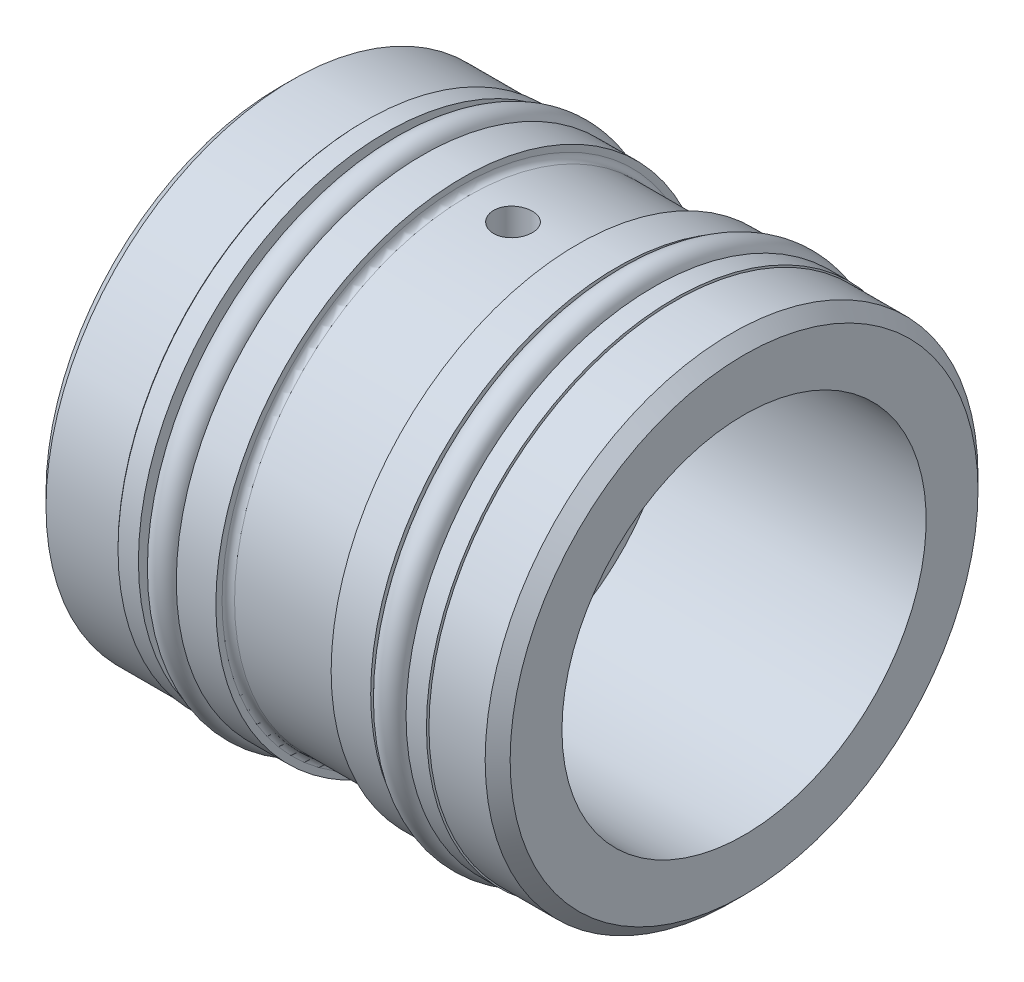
ISO-10303-21;
HEADER;
FILE_DESCRIPTION(('STEP AP214'),'2;1');
FILE_NAME('part.step','',(''),(''),'','','');
FILE_SCHEMA(('AUTOMOTIVE_DESIGN { 1 0 10303 214 1 1 1 1 }'));
ENDSEC;
DATA;
#1=APPLICATION_CONTEXT('core data for automotive mechanical design processes');
#2=APPLICATION_PROTOCOL_DEFINITION('international standard','automotive_design',2000,#1);
#3=PRODUCT_CONTEXT('',#1,'mechanical');
#4=PRODUCT('Part','Part','',(#3));
#5=PRODUCT_RELATED_PRODUCT_CATEGORY('part','',(#4));
#6=PRODUCT_DEFINITION_FORMATION('','',#4);
#7=PRODUCT_DEFINITION_CONTEXT('part definition',#1,'design');
#8=PRODUCT_DEFINITION('design','',#6,#7);
#9=PRODUCT_DEFINITION_SHAPE('','',#8);
#10=(LENGTH_UNIT() NAMED_UNIT(*) SI_UNIT(.MILLI.,.METRE.));
#11=(NAMED_UNIT(*) PLANE_ANGLE_UNIT() SI_UNIT($,.RADIAN.));
#12=(NAMED_UNIT(*) SI_UNIT($,.STERADIAN.) SOLID_ANGLE_UNIT());
#13=UNCERTAINTY_MEASURE_WITH_UNIT(LENGTH_MEASURE(1.E-05),#10,'distance_accuracy_value','');
#14=(GEOMETRIC_REPRESENTATION_CONTEXT(3) GLOBAL_UNCERTAINTY_ASSIGNED_CONTEXT((#13)) GLOBAL_UNIT_ASSIGNED_CONTEXT((#10,
#11,#12)) REPRESENTATION_CONTEXT('',''));
#15=CARTESIAN_POINT('',(0.,0.,0.));
#16=DIRECTION('',(0.,0.,1.));
#17=DIRECTION('',(1.,0.,0.));
#18=AXIS2_PLACEMENT_3D('',#15,#16,#17);
#19=CARTESIAN_POINT('',(0.,0.,0.));
#20=DIRECTION('',(-1.,0.,0.));
#21=DIRECTION('',(0.,0.,1.));
#22=AXIS2_PLACEMENT_3D('',#19,#20,#21);
#23=CYLINDRICAL_SURFACE('',#22,13.7668);
#24=CARTESIAN_POINT('',(7.73880715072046,0.,0.));
#25=DIRECTION('',(-1.,0.,0.));
#26=DIRECTION('',(0.,0.,1.));
#27=AXIS2_PLACEMENT_3D('',#24,#25,#26);
#28=CIRCLE('',#27,13.7668);
#29=CARTESIAN_POINT('',(7.73880715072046,0.,13.7668));
#30=VERTEX_POINT('',#29);
#31=EDGE_CURVE('E147',#30,#30,#28,.T.);
#32=ORIENTED_EDGE('',*,*,#31,.F.);
#33=EDGE_LOOP('',(#32));
#34=FACE_BOUND('',#33,.T.);
#35=CARTESIAN_POINT('',(8.6487,0.,0.));
#36=DIRECTION('',(1.,0.,0.));
#37=DIRECTION('',(0.,0.,-1.));
#38=AXIS2_PLACEMENT_3D('',#35,#36,#37);
#39=CIRCLE('',#38,13.7668);
#40=CARTESIAN_POINT('',(8.6487,0.,-13.7668));
#41=VERTEX_POINT('',#40);
#42=EDGE_CURVE('E10',#41,#41,#39,.T.);
#43=ORIENTED_EDGE('',*,*,#42,.F.);
#44=EDGE_LOOP('',(#43));
#45=FACE_BOUND('',#44,.T.);
#46=ADVANCED_FACE('F32',(#34,#45),#23,.T.);
#47=CARTESIAN_POINT('',(9.9695,0.,0.));
#48=DIRECTION('',(-1.,0.,0.));
#49=DIRECTION('',(0.,0.,1.));
#50=AXIS2_PLACEMENT_3D('',#47,#48,#49);
#51=CIRCLE('',#50,13.7668);
#52=CARTESIAN_POINT('',(9.9695,0.,13.7668));
#53=VERTEX_POINT('',#52);
#54=EDGE_CURVE('E199',#53,#53,#51,.T.);
#55=ORIENTED_EDGE('',*,*,#54,.T.);
#56=EDGE_LOOP('',(#55));
#57=FACE_BOUND('',#56,.T.);
#58=CARTESIAN_POINT('',(9.89329999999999,0.,0.));
#59=DIRECTION('',(-1.,0.,0.));
#60=DIRECTION('',(0.,0.,1.));
#61=AXIS2_PLACEMENT_3D('',#58,#59,#60);
#62=CIRCLE('',#61,13.7668);
#63=CARTESIAN_POINT('',(9.89329999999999,0.,13.7668));
#64=VERTEX_POINT('',#63);
#65=EDGE_CURVE('E44',#64,#64,#62,.T.);
#66=ORIENTED_EDGE('',*,*,#65,.F.);
#67=EDGE_LOOP('',(#66));
#68=FACE_BOUND('',#67,.T.);
#69=ADVANCED_FACE('F119',(#57,#68),#23,.T.);
#70=CARTESIAN_POINT('',(6.4135,0.,0.));
#71=DIRECTION('',(-1.,0.,0.));
#72=DIRECTION('',(0.,0.,1.));
#73=AXIS2_PLACEMENT_3D('',#70,#71,#72);
#74=CIRCLE('',#73,13.7668);
#75=CARTESIAN_POINT('',(6.4135,0.,13.7668));
#76=VERTEX_POINT('',#75);
#77=EDGE_CURVE('E143',#76,#76,#74,.T.);
#78=ORIENTED_EDGE('',*,*,#77,.F.);
#79=EDGE_LOOP('',(#78));
#80=FACE_BOUND('',#79,.T.);
#81=CARTESIAN_POINT('',(7.01859284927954,0.,0.));
#82=DIRECTION('',(1.,0.,0.));
#83=DIRECTION('',(0.,0.,-1.));
#84=AXIS2_PLACEMENT_3D('',#81,#82,#83);
#85=CIRCLE('',#84,13.7668);
#86=CARTESIAN_POINT('',(7.01859284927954,0.,-13.7668));
#87=VERTEX_POINT('',#86);
#88=EDGE_CURVE('E49',#87,#87,#85,.T.);
#89=ORIENTED_EDGE('',*,*,#88,.F.);
#90=EDGE_LOOP('',(#89));
#91=FACE_BOUND('',#90,.T.);
#92=ADVANCED_FACE('F122',(#80,#91),#23,.T.);
#93=CARTESIAN_POINT('',(0.,0.,0.));
#94=DIRECTION('',(-1.,0.,0.));
#95=DIRECTION('',(0.,0.,1.));
#96=AXIS2_PLACEMENT_3D('',#93,#94,#95);
#97=CYLINDRICAL_SURFACE('',#96,13.7668);
#98=CARTESIAN_POINT('',(-7.6835,0.,0.));
#99=DIRECTION('',(-1.,0.,0.));
#100=DIRECTION('',(0.,0.,1.));
#101=AXIS2_PLACEMENT_3D('',#98,#99,#100);
#102=CIRCLE('',#101,13.7668);
#103=CARTESIAN_POINT('',(-7.6835,0.,13.7668));
#104=VERTEX_POINT('',#103);
#105=EDGE_CURVE('E160',#104,#104,#102,.T.);
#106=ORIENTED_EDGE('',*,*,#105,.F.);
#107=EDGE_LOOP('',(#106));
#108=FACE_BOUND('',#107,.T.);
#109=CARTESIAN_POINT('',(-6.77360715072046,0.,0.));
#110=DIRECTION('',(1.,0.,0.));
#111=DIRECTION('',(0.,0.,-1.));
#112=AXIS2_PLACEMENT_3D('',#109,#110,#111);
#113=CIRCLE('',#112,13.7668);
#114=CARTESIAN_POINT('',(-6.77360715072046,0.,-13.7668));
#115=VERTEX_POINT('',#114);
#116=EDGE_CURVE('E149',#115,#115,#113,.T.);
#117=ORIENTED_EDGE('',*,*,#116,.F.);
#118=EDGE_LOOP('',(#117));
#119=FACE_BOUND('',#118,.T.);
#120=ADVANCED_FACE('F132',(#108,#119),#97,.T.);
#121=CARTESIAN_POINT('',(-5.4483,0.,0.));
#122=DIRECTION('',(-1.,0.,0.));
#123=DIRECTION('',(0.,0.,1.));
#124=AXIS2_PLACEMENT_3D('',#121,#122,#123);
#125=CIRCLE('',#124,13.7668);
#126=CARTESIAN_POINT('',(-5.4483,0.,13.7668));
#127=VERTEX_POINT('',#126);
#128=EDGE_CURVE('E215',#127,#127,#125,.T.);
#129=ORIENTED_EDGE('',*,*,#128,.T.);
#130=EDGE_LOOP('',(#129));
#131=FACE_BOUND('',#130,.T.);
#132=CARTESIAN_POINT('',(-6.05339284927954,0.,0.));
#133=DIRECTION('',(-1.,0.,0.));
#134=DIRECTION('',(0.,0.,1.));
#135=AXIS2_PLACEMENT_3D('',#132,#133,#134);
#136=CIRCLE('',#135,13.7668);
#137=CARTESIAN_POINT('',(-6.05339284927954,0.,13.7668));
#138=VERTEX_POINT('',#137);
#139=EDGE_CURVE('E154',#138,#138,#136,.T.);
#140=ORIENTED_EDGE('',*,*,#139,.F.);
#141=EDGE_LOOP('',(#140));
#142=FACE_BOUND('',#141,.T.);
#143=ADVANCED_FACE('F137',(#131,#142),#97,.T.);
#144=CARTESIAN_POINT('',(-9.0043,0.,0.));
#145=DIRECTION('',(-1.,0.,0.));
#146=DIRECTION('',(0.,0.,1.));
#147=AXIS2_PLACEMENT_3D('',#144,#145,#146);
#148=CIRCLE('',#147,13.7668);
#149=CARTESIAN_POINT('',(-9.0043,0.,13.7668));
#150=VERTEX_POINT('',#149);
#151=EDGE_CURVE('E218',#150,#150,#148,.T.);
#152=ORIENTED_EDGE('',*,*,#151,.F.);
#153=EDGE_LOOP('',(#152));
#154=FACE_BOUND('',#153,.T.);
#155=CARTESIAN_POINT('',(-8.9281,0.,0.));
#156=DIRECTION('',(1.,0.,0.));
#157=DIRECTION('',(0.,0.,-1.));
#158=AXIS2_PLACEMENT_3D('',#155,#156,#157);
#159=CIRCLE('',#158,13.7668);
#160=CARTESIAN_POINT('',(-8.9281,0.,-13.7668));
#161=VERTEX_POINT('',#160);
#162=EDGE_CURVE('E157',#161,#161,#159,.T.);
#163=ORIENTED_EDGE('',*,*,#162,.F.);
#164=EDGE_LOOP('',(#163));
#165=FACE_BOUND('',#164,.T.);
#166=ADVANCED_FACE('F98',(#154,#165),#97,.T.);
#167=CARTESIAN_POINT('',(0.,0.,0.));
#168=DIRECTION('',(-1.,0.,0.));
#169=DIRECTION('',(0.,0.,1.));
#170=AXIS2_PLACEMENT_3D('',#167,#168,#169);
#171=CYLINDRICAL_SURFACE('',#170,6.35);
#172=CARTESIAN_POINT('',(-1.2319,0.,0.));
#173=DIRECTION('',(-1.,0.,0.));
#174=DIRECTION('',(0.,0.,1.));
#175=AXIS2_PLACEMENT_3D('',#172,#173,#174);
#176=CIRCLE('',#175,6.35);
#177=CARTESIAN_POINT('',(-1.2319,0.,6.35));
#178=VERTEX_POINT('',#177);
#179=EDGE_CURVE('E187',#178,#178,#176,.T.);
#180=ORIENTED_EDGE('',*,*,#179,.F.);
#181=EDGE_LOOP('',(#180));
#182=FACE_BOUND('',#181,.T.);
#183=CARTESIAN_POINT('',(-14.1605,0.,0.));
#184=DIRECTION('',(-1.,0.,0.));
#185=DIRECTION('',(0.,0.,1.));
#186=AXIS2_PLACEMENT_3D('',#183,#184,#185);
#187=CIRCLE('',#186,6.35);
#188=CARTESIAN_POINT('',(-14.1605,0.,6.35));
#189=VERTEX_POINT('',#188);
#190=EDGE_CURVE('E224',#189,#189,#187,.T.);
#191=ORIENTED_EDGE('',*,*,#190,.T.);
#192=EDGE_LOOP('',(#191));
#193=FACE_BOUND('',#192,.T.);
#194=ADVANCED_FACE('F94',(#182,#193),#171,.F.);
#195=CARTESIAN_POINT('',(-1.2319,6.35,0.));
#196=DIRECTION('',(-1.,0.,0.));
#197=DIRECTION('',(0.,0.,1.));
#198=AXIS2_PLACEMENT_3D('',#195,#196,#197);
#199=PLANE('',#198);
#200=CARTESIAN_POINT('',(-1.2319,0.,0.));
#201=DIRECTION('',(-1.,0.,0.));
#202=DIRECTION('',(0.,0.,1.));
#203=AXIS2_PLACEMENT_3D('',#200,#201,#202);
#204=CIRCLE('',#203,11.1125);
#205=CARTESIAN_POINT('',(-1.2319,0.,11.1125));
#206=VERTEX_POINT('',#205);
#207=EDGE_CURVE('E190',#206,#206,#204,.T.);
#208=ORIENTED_EDGE('',*,*,#207,.F.);
#209=EDGE_LOOP('',(#208));
#210=FACE_BOUND('',#209,.T.);
#211=ORIENTED_EDGE('',*,*,#179,.T.);
#212=EDGE_LOOP('',(#211));
#213=FACE_BOUND('',#212,.T.);
#214=ADVANCED_FACE('F88',(#210,#213),#199,.F.);
#215=CARTESIAN_POINT('',(0.,0.,0.));
#216=DIRECTION('',(-1.,0.,0.));
#217=DIRECTION('',(0.,0.,1.));
#218=AXIS2_PLACEMENT_3D('',#215,#216,#217);
#219=CYLINDRICAL_SURFACE('',#218,11.1125);
#220=CARTESIAN_POINT('',(0.0634999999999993,-11.0495546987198,1.1811));
#221=CARTESIAN_POINT('',(-0.00264156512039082,-11.0495555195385,1.18109714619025));
#222=CARTESIAN_POINT('',(-0.0688263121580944,-11.0501549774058,1.17552539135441));
#223=CARTESIAN_POINT('',(-0.199359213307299,-11.0524875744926,1.15338363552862));
#224=CARTESIAN_POINT('',(-0.263705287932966,-11.054221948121,1.13680165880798));
#225=CARTESIAN_POINT('',(-0.388651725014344,-11.0586257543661,1.09312916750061));
#226=CARTESIAN_POINT('',(-0.449254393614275,-11.0612946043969,1.06604519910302));
#227=CARTESIAN_POINT('',(-0.565041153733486,-11.0672659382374,1.00215046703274));
#228=CARTESIAN_POINT('',(-0.620226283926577,-11.0705683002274,0.965341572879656));
#229=CARTESIAN_POINT('',(-0.723849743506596,-11.0774496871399,0.882880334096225));
#230=CARTESIAN_POINT('',(-0.772262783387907,-11.0810296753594,0.837196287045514));
#231=CARTESIAN_POINT('',(-0.860749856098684,-11.0880542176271,0.73834944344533));
#232=CARTESIAN_POINT('',(-0.900823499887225,-11.0914987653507,0.685186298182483));
#233=CARTESIAN_POINT('',(-0.971582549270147,-11.097873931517,0.57273433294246));
#234=CARTESIAN_POINT('',(-1.00224543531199,-11.1008033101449,0.5134312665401));
#235=CARTESIAN_POINT('',(-1.05316845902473,-11.105807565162,0.39048157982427));
#236=CARTESIAN_POINT('',(-1.07342888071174,-11.1078824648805,0.326835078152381));
#237=CARTESIAN_POINT('',(-1.10289730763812,-11.1109372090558,0.197261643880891));
#238=CARTESIAN_POINT('',(-1.11214699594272,-11.1119211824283,0.131344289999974));
#239=CARTESIAN_POINT('',(-1.1194604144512,-11.11269726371,-0.00111401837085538));
#240=CARTESIAN_POINT('',(-1.11752446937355,-11.1124894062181,-0.067654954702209));
#241=CARTESIAN_POINT('',(-1.10255531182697,-11.1109086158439,-0.199188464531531));
#242=CARTESIAN_POINT('',(-1.08956692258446,-11.1095403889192,-0.264186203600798));
#243=CARTESIAN_POINT('',(-1.05293145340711,-11.1057979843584,-0.391074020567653));
#244=CARTESIAN_POINT('',(-1.02928421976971,-11.1034237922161,-0.452964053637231));
#245=CARTESIAN_POINT('',(-0.971953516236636,-11.0979282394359,-0.572020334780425));
#246=CARTESIAN_POINT('',(-0.938250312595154,-11.0948054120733,-0.629177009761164));
#247=CARTESIAN_POINT('',(-0.861778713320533,-11.088162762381,-0.737039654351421));
#248=CARTESIAN_POINT('',(-0.819010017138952,-11.0846429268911,-0.787745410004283));
#249=CARTESIAN_POINT('',(-0.725369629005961,-11.0775804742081,-0.881529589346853));
#250=CARTESIAN_POINT('',(-0.674458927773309,-11.0740378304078,-0.924569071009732));
#251=CARTESIAN_POINT('',(-0.566114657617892,-11.0673463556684,-1.00149721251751));
#252=CARTESIAN_POINT('',(-0.508681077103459,-11.0641975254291,-1.0353858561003));
#253=CARTESIAN_POINT('',(-0.388890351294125,-11.0586500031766,-1.09305071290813));
#254=CARTESIAN_POINT('',(-0.326531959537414,-11.0562515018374,-1.11682435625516));
#255=CARTESIAN_POINT('',(-0.198677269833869,-11.0524801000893,-1.15355269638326));
#256=CARTESIAN_POINT('',(-0.133181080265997,-11.0511071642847,-1.16650776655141));
#257=CARTESIAN_POINT('',(-0.00125233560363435,-11.0495485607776,-1.1811807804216));
#258=CARTESIAN_POINT('',(0.0651740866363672,-11.049357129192,-1.1829532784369));
#259=CARTESIAN_POINT('',(0.197378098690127,-11.0501679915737,-1.17535425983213));
#260=CARTESIAN_POINT('',(0.263155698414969,-11.0511702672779,-1.16598291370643));
#261=CARTESIAN_POINT('',(0.392034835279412,-11.0542503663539,-1.13640793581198));
#262=CARTESIAN_POINT('',(0.455142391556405,-11.0563256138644,-1.11623024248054));
#263=CARTESIAN_POINT('',(0.577077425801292,-11.0613157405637,-1.0656418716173));
#264=CARTESIAN_POINT('',(0.635904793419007,-11.0642306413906,-1.03523093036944));
#265=CARTESIAN_POINT('',(0.74785779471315,-11.07058556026,-0.964903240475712));
#266=CARTESIAN_POINT('',(0.800960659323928,-11.0740275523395,-0.924950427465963));
#267=CARTESIAN_POINT('',(0.899726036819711,-11.0810424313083,-0.836724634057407));
#268=CARTESIAN_POINT('',(0.945388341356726,-11.0846153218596,-0.788451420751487));
#269=CARTESIAN_POINT('',(1.02816535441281,-11.091506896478,-0.684718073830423));
#270=CARTESIAN_POINT('',(1.06524441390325,-11.0948244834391,-0.629229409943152));
#271=CARTESIAN_POINT('',(1.12955677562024,-11.1008155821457,-0.512780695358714));
#272=CARTESIAN_POINT('',(1.15679022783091,-11.1034891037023,-0.451820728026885));
#273=CARTESIAN_POINT('',(1.20057826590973,-11.1078859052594,-0.326282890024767));
#274=CARTESIAN_POINT('',(1.21715416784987,-11.1096110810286,-0.261712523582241));
#275=CARTESIAN_POINT('',(1.2392260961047,-11.1119246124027,-0.130685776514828));
#276=CARTESIAN_POINT('',(1.2447224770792,-11.1125130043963,-0.064229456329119));
#277=CARTESIAN_POINT('',(1.24447398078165,-11.1124866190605,0.0683330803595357));
#278=CARTESIAN_POINT('',(1.23878435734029,-11.1118777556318,0.134439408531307));
#279=CARTESIAN_POINT('',(1.21644149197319,-11.1095369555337,0.264751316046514));
#280=CARTESIAN_POINT('',(1.19978824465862,-11.1078050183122,0.328956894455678));
#281=CARTESIAN_POINT('',(1.15600665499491,-11.1034120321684,0.453642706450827));
#282=CARTESIAN_POINT('',(1.1288801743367,-11.1007511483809,0.514123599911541));
#283=CARTESIAN_POINT('',(1.0649279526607,-11.0947964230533,0.629682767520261));
#284=CARTESIAN_POINT('',(1.02810222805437,-11.0915025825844,0.684761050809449));
#285=CARTESIAN_POINT('',(0.945590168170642,-11.0846311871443,0.788234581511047));
#286=CARTESIAN_POINT('',(0.899862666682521,-11.0810523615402,0.836596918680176));
#287=CARTESIAN_POINT('',(0.800927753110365,-11.0740249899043,0.92498548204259));
#288=CARTESIAN_POINT('',(0.747718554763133,-11.0705764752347,0.965009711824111));
#289=CARTESIAN_POINT('',(0.635163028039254,-11.0641897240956,1.03567775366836));
#290=CARTESIAN_POINT('',(0.575799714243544,-11.0612529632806,1.06629462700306));
#291=CARTESIAN_POINT('',(0.452780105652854,-11.0562397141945,1.11708410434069));
#292=CARTESIAN_POINT('',(0.389128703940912,-11.054162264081,1.13726839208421));
#293=CARTESIAN_POINT('',(0.281519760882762,-11.051622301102,1.16163240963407));
#294=CARTESIAN_POINT('',(0.238248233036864,-11.0508506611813,1.16892266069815));
#295=CARTESIAN_POINT('',(0.151157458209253,-11.0498165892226,1.17865738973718));
#296=CARTESIAN_POINT('',(0.107338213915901,-11.0495541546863,1.18110189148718));
#297=CARTESIAN_POINT('',(0.0634999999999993,-11.0495546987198,1.1811));
#298=B_SPLINE_CURVE_WITH_KNOTS('',3,(#220,#221,#222,#223,#224,#225,#226,#227,#228,#229,#230,
#231,#232,#233,#234,#235,#236,#237,#238,#239,#240,#241,#242,#243,#244,#245,#246,#247,#248,#249,
#250,#251,#252,#253,#254,#255,#256,#257,#258,#259,#260,#261,#262,#263,#264,#265,#266,#267,#268,
#269,#270,#271,#272,#273,#274,#275,#276,#277,#278,#279,#280,#281,#282,#283,#284,#285,#286,#287,
#288,#289,#290,#291,#292,#293,#294,#295,#296,#297),.UNSPECIFIED.,.T.,.F.,(4,2,2,2,2,2,2,2,2,2,2,
2,2,2,2,2,2,2,2,2,2,2,2,2,2,2,2,2,2,2,2,2,2,2,2,2,2,2,4),(0.,0.198264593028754,
0.396745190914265,0.595102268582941,0.793421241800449,0.99246209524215,1.19151223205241,
1.39103503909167,1.59055239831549,1.78931202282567,1.98806587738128,2.18601750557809,
2.38397198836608,2.58231751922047,2.78066962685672,2.98000221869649,3.17933516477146,
3.37871872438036,3.57809540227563,3.77649866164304,3.97489888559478,4.17282501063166,
4.37075623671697,4.5694477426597,4.76814481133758,4.96765289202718,5.16715793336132,
5.36626269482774,5.56536108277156,5.76347848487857,5.96159598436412,6.15967828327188,
6.35776024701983,6.55678098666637,6.75584932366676,6.95548250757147,7.15489162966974,
7.28630080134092,7.41770932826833),.UNSPECIFIED.);
#299=CARTESIAN_POINT('',(0.0634999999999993,-11.0495546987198,1.1811));
#300=VERTEX_POINT('',#299);
#301=EDGE_CURVE('E78',#300,#300,#298,.T.);
#302=ORIENTED_EDGE('',*,*,#301,.T.);
#303=EDGE_LOOP('',(#302));
#304=FACE_BOUND('',#303,.T.);
#305=CARTESIAN_POINT('',(0.0634999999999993,11.0495546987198,1.1811));
#306=CARTESIAN_POINT('',(0.129641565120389,11.0495555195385,1.18109714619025));
#307=CARTESIAN_POINT('',(0.195826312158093,11.0501549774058,1.17552539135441));
#308=CARTESIAN_POINT('',(0.326359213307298,11.0524875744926,1.15338363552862));
#309=CARTESIAN_POINT('',(0.390705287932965,11.054221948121,1.13680165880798));
#310=CARTESIAN_POINT('',(0.515651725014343,11.0586257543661,1.09312916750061));
#311=CARTESIAN_POINT('',(0.576254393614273,11.0612946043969,1.06604519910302));
#312=CARTESIAN_POINT('',(0.692041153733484,11.0672659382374,1.00215046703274));
#313=CARTESIAN_POINT('',(0.747226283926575,11.0705683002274,0.965341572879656));
#314=CARTESIAN_POINT('',(0.850849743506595,11.0774496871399,0.882880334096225));
#315=CARTESIAN_POINT('',(0.899262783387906,11.0810296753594,0.837196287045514));
#316=CARTESIAN_POINT('',(0.987749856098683,11.0880542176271,0.73834944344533));
#317=CARTESIAN_POINT('',(1.02782349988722,11.0914987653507,0.685186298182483));
#318=CARTESIAN_POINT('',(1.09858254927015,11.097873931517,0.57273433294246));
#319=CARTESIAN_POINT('',(1.12924543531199,11.1008033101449,0.5134312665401));
#320=CARTESIAN_POINT('',(1.18016845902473,11.105807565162,0.39048157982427));
#321=CARTESIAN_POINT('',(1.20042888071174,11.1078824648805,0.326835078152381));
#322=CARTESIAN_POINT('',(1.22989730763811,11.1109372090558,0.197261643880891));
#323=CARTESIAN_POINT('',(1.23914699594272,11.1119211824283,0.131344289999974));
#324=CARTESIAN_POINT('',(1.2464604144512,11.11269726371,-0.00111401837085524));
#325=CARTESIAN_POINT('',(1.24452446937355,11.1124894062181,-0.0676549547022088));
#326=CARTESIAN_POINT('',(1.22955531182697,11.1109086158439,-0.199188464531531));
#327=CARTESIAN_POINT('',(1.21656692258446,11.1095403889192,-0.264186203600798));
#328=CARTESIAN_POINT('',(1.17993145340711,11.1057979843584,-0.391074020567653));
#329=CARTESIAN_POINT('',(1.15628421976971,11.1034237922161,-0.452964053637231));
#330=CARTESIAN_POINT('',(1.09895351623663,11.0979282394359,-0.572020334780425));
#331=CARTESIAN_POINT('',(1.06525031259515,11.0948054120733,-0.629177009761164));
#332=CARTESIAN_POINT('',(0.988778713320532,11.088162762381,-0.737039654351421));
#333=CARTESIAN_POINT('',(0.946010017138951,11.0846429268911,-0.787745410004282));
#334=CARTESIAN_POINT('',(0.85236962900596,11.0775804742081,-0.881529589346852));
#335=CARTESIAN_POINT('',(0.801458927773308,11.0740378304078,-0.924569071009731));
#336=CARTESIAN_POINT('',(0.693114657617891,11.0673463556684,-1.00149721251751));
#337=CARTESIAN_POINT('',(0.635681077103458,11.0641975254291,-1.0353858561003));
#338=CARTESIAN_POINT('',(0.515890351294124,11.0586500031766,-1.09305071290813));
#339=CARTESIAN_POINT('',(0.453531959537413,11.0562515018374,-1.11682435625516));
#340=CARTESIAN_POINT('',(0.325677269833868,11.0524801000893,-1.15355269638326));
#341=CARTESIAN_POINT('',(0.260181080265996,11.0511071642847,-1.16650776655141));
#342=CARTESIAN_POINT('',(0.128252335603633,11.0495485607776,-1.1811807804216));
#343=CARTESIAN_POINT('',(0.061825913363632,11.049357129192,-1.1829532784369));
#344=CARTESIAN_POINT('',(-0.0703780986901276,11.0501679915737,-1.17535425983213));
#345=CARTESIAN_POINT('',(-0.136155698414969,11.0511702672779,-1.16598291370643));
#346=CARTESIAN_POINT('',(-0.265034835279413,11.0542503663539,-1.13640793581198));
#347=CARTESIAN_POINT('',(-0.328142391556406,11.0563256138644,-1.11623024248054));
#348=CARTESIAN_POINT('',(-0.450077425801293,11.0613157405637,-1.0656418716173));
#349=CARTESIAN_POINT('',(-0.508904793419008,11.0642306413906,-1.03523093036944));
#350=CARTESIAN_POINT('',(-0.620857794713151,11.07058556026,-0.964903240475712));
#351=CARTESIAN_POINT('',(-0.673960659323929,11.0740275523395,-0.924950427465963));
#352=CARTESIAN_POINT('',(-0.772726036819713,11.0810424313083,-0.836724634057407));
#353=CARTESIAN_POINT('',(-0.818388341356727,11.0846153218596,-0.788451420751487));
#354=CARTESIAN_POINT('',(-0.901165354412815,11.091506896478,-0.684718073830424));
#355=CARTESIAN_POINT('',(-0.938244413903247,11.0948244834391,-0.629229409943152));
#356=CARTESIAN_POINT('',(-1.00255677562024,11.1008155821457,-0.512780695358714));
#357=CARTESIAN_POINT('',(-1.02979022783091,11.1034891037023,-0.451820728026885));
#358=CARTESIAN_POINT('',(-1.07357826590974,11.1078859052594,-0.326282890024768));
#359=CARTESIAN_POINT('',(-1.09015416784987,11.1096110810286,-0.261712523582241));
#360=CARTESIAN_POINT('',(-1.1122260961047,11.1119246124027,-0.130685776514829));
#361=CARTESIAN_POINT('',(-1.1177224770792,11.1125130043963,-0.0642294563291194));
#362=CARTESIAN_POINT('',(-1.11747398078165,11.1124866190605,0.0683330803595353));
#363=CARTESIAN_POINT('',(-1.11178435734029,11.1118777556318,0.134439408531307));
#364=CARTESIAN_POINT('',(-1.08944149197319,11.1095369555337,0.264751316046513));
#365=CARTESIAN_POINT('',(-1.07278824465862,11.1078050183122,0.328956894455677));
#366=CARTESIAN_POINT('',(-1.02900665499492,11.1034120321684,0.453642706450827));
#367=CARTESIAN_POINT('',(-1.0018801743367,11.1007511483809,0.514123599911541));
#368=CARTESIAN_POINT('',(-0.937927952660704,11.0947964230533,0.62968276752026));
#369=CARTESIAN_POINT('',(-0.901102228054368,11.0915025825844,0.684761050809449));
#370=CARTESIAN_POINT('',(-0.818590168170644,11.0846311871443,0.788234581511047));
#371=CARTESIAN_POINT('',(-0.772862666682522,11.0810523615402,0.836596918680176));
#372=CARTESIAN_POINT('',(-0.673927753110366,11.0740249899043,0.924985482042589));
#373=CARTESIAN_POINT('',(-0.620718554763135,11.0705764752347,0.965009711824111));
#374=CARTESIAN_POINT('',(-0.508163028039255,11.0641897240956,1.03567775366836));
#375=CARTESIAN_POINT('',(-0.448799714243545,11.0612529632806,1.06629462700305));
#376=CARTESIAN_POINT('',(-0.325780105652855,11.0562397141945,1.11708410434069));
#377=CARTESIAN_POINT('',(-0.262128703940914,11.054162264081,1.13726839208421));
#378=CARTESIAN_POINT('',(-0.154519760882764,11.051622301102,1.16163240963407));
#379=CARTESIAN_POINT('',(-0.111248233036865,11.0508506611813,1.16892266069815));
#380=CARTESIAN_POINT('',(-0.0241574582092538,11.0498165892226,1.17865738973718));
#381=CARTESIAN_POINT('',(0.0196617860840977,11.0495541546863,1.18110189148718));
#382=CARTESIAN_POINT('',(0.0634999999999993,11.0495546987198,1.1811));
#383=B_SPLINE_CURVE_WITH_KNOTS('',3,(#305,#306,#307,#308,#309,#310,#311,#312,#313,#314,#315,
#316,#317,#318,#319,#320,#321,#322,#323,#324,#325,#326,#327,#328,#329,#330,#331,#332,#333,#334,
#335,#336,#337,#338,#339,#340,#341,#342,#343,#344,#345,#346,#347,#348,#349,#350,#351,#352,#353,
#354,#355,#356,#357,#358,#359,#360,#361,#362,#363,#364,#365,#366,#367,#368,#369,#370,#371,#372,
#373,#374,#375,#376,#377,#378,#379,#380,#381,#382),.UNSPECIFIED.,.T.,.F.,(4,2,2,2,2,2,2,2,2,2,2,
2,2,2,2,2,2,2,2,2,2,2,2,2,2,2,2,2,2,2,2,2,2,2,2,2,2,2,4),(0.,0.198264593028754,
0.396745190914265,0.595102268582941,0.793421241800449,0.99246209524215,1.19151223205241,
1.39103503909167,1.59055239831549,1.78931202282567,1.98806587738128,2.18601750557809,
2.38397198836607,2.58231751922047,2.78066962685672,2.98000221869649,3.17933516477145,
3.37871872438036,3.57809540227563,3.77649866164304,3.97489888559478,4.17282501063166,
4.37075623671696,4.5694477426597,4.76814481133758,4.96765289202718,5.16715793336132,
5.36626269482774,5.56536108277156,5.76347848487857,5.96159598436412,6.15967828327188,
6.35776024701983,6.55678098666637,6.75584932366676,6.95548250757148,7.15489162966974,
7.28630080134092,7.41770932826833),.UNSPECIFIED.);
#384=CARTESIAN_POINT('',(0.0634999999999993,11.0495546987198,1.1811));
#385=VERTEX_POINT('',#384);
#386=EDGE_CURVE('E73',#385,#385,#383,.T.);
#387=ORIENTED_EDGE('',*,*,#386,.T.);
#388=EDGE_LOOP('',(#387));
#389=FACE_BOUND('',#388,.T.);
#390=CARTESIAN_POINT('',(14.1605,0.,0.));
#391=DIRECTION('',(-1.,0.,0.));
#392=DIRECTION('',(0.,0.,1.));
#393=AXIS2_PLACEMENT_3D('',#390,#391,#392);
#394=CIRCLE('',#393,11.1125);
#395=CARTESIAN_POINT('',(14.1605,0.,11.1125));
#396=VERTEX_POINT('',#395);
#397=EDGE_CURVE('E193',#396,#396,#394,.T.);
#398=ORIENTED_EDGE('',*,*,#397,.F.);
#399=EDGE_LOOP('',(#398));
#400=FACE_BOUND('',#399,.T.);
#401=ORIENTED_EDGE('',*,*,#207,.T.);
#402=EDGE_LOOP('',(#401));
#403=FACE_BOUND('',#402,.T.);
#404=ADVANCED_FACE('F82',(#304,#389,#400,#403),#219,.F.);
#405=CARTESIAN_POINT('',(14.1605,15.0368,0.));
#406=DIRECTION('',(-1.,0.,0.));
#407=DIRECTION('',(0.,0.,1.));
#408=AXIS2_PLACEMENT_3D('',#405,#406,#407);
#409=PLANE('',#408);
#410=CARTESIAN_POINT('',(14.1605,0.,0.));
#411=DIRECTION('',(-1.,0.,0.));
#412=DIRECTION('',(0.,0.,1.));
#413=AXIS2_PLACEMENT_3D('',#410,#411,#412);
#414=CIRCLE('',#413,14.2748);
#415=CARTESIAN_POINT('',(14.1605,0.,14.2748));
#416=VERTEX_POINT('',#415);
#417=EDGE_CURVE('E169',#416,#416,#414,.F.);
#418=ORIENTED_EDGE('',*,*,#417,.T.);
#419=EDGE_LOOP('',(#418));
#420=FACE_BOUND('',#419,.T.);
#421=ORIENTED_EDGE('',*,*,#397,.T.);
#422=EDGE_LOOP('',(#421));
#423=FACE_BOUND('',#422,.T.);
#424=ADVANCED_FACE('F87',(#420,#423),#409,.F.);
#425=CARTESIAN_POINT('',(0.,0.,0.));
#426=DIRECTION('',(-1.,0.,0.));
#427=DIRECTION('',(0.,0.,1.));
#428=AXIS2_PLACEMENT_3D('',#425,#426,#427);
#429=CYLINDRICAL_SURFACE('',#428,15.0368);
#430=CARTESIAN_POINT('',(13.3985,0.,0.));
#431=DIRECTION('',(-1.,0.,0.));
#432=DIRECTION('',(0.,0.,1.));
#433=AXIS2_PLACEMENT_3D('',#430,#431,#432);
#434=CIRCLE('',#433,15.0368);
#435=CARTESIAN_POINT('',(13.3985,0.,15.0368));
#436=VERTEX_POINT('',#435);
#437=EDGE_CURVE('E172',#436,#436,#434,.T.);
#438=ORIENTED_EDGE('',*,*,#437,.T.);
#439=EDGE_LOOP('',(#438));
#440=FACE_BOUND('',#439,.T.);
#441=CARTESIAN_POINT('',(9.9695,0.,0.));
#442=DIRECTION('',(-1.,0.,0.));
#443=DIRECTION('',(0.,0.,1.));
#444=AXIS2_PLACEMENT_3D('',#441,#442,#443);
#445=CIRCLE('',#444,15.0368);
#446=CARTESIAN_POINT('',(9.9695,0.,15.0368));
#447=VERTEX_POINT('',#446);
#448=EDGE_CURVE('E196',#447,#447,#445,.T.);
#449=ORIENTED_EDGE('',*,*,#448,.F.);
#450=EDGE_LOOP('',(#449));
#451=FACE_BOUND('',#450,.T.);
#452=ADVANCED_FACE('F419',(#440,#451),#429,.T.);
#453=CARTESIAN_POINT('',(9.9695,15.0368,0.));
#454=DIRECTION('',(1.,0.,0.));
#455=DIRECTION('',(0.,0.,-1.));
#456=AXIS2_PLACEMENT_3D('',#453,#454,#455);
#457=PLANE('',#456);
#458=ORIENTED_EDGE('',*,*,#54,.F.);
#459=EDGE_LOOP('',(#458));
#460=FACE_BOUND('',#459,.T.);
#461=ORIENTED_EDGE('',*,*,#448,.T.);
#462=EDGE_LOOP('',(#461));
#463=FACE_BOUND('',#462,.T.);
#464=ADVANCED_FACE('F427',(#460,#463),#457,.F.);
#465=CARTESIAN_POINT('',(6.4135,13.7668,0.));
#466=DIRECTION('',(-1.,0.,0.));
#467=DIRECTION('',(0.,0.,1.));
#468=AXIS2_PLACEMENT_3D('',#465,#466,#467);
#469=PLANE('',#468);
#470=CARTESIAN_POINT('',(6.4135,0.,0.));
#471=DIRECTION('',(-1.,0.,0.));
#472=DIRECTION('',(0.,0.,1.));
#473=AXIS2_PLACEMENT_3D('',#470,#471,#472);
#474=CIRCLE('',#473,15.0368);
#475=CARTESIAN_POINT('',(6.4135,0.,15.0368));
#476=VERTEX_POINT('',#475);
#477=EDGE_CURVE('E203',#476,#476,#474,.T.);
#478=ORIENTED_EDGE('',*,*,#477,.F.);
#479=EDGE_LOOP('',(#478));
#480=FACE_BOUND('',#479,.T.);
#481=ORIENTED_EDGE('',*,*,#77,.T.);
#482=EDGE_LOOP('',(#481));
#483=FACE_BOUND('',#482,.T.);
#484=ADVANCED_FACE('F434',(#480,#483),#469,.F.);
#485=CARTESIAN_POINT('',(0.,0.,0.));
#486=DIRECTION('',(-1.,0.,0.));
#487=DIRECTION('',(0.,0.,1.));
#488=AXIS2_PLACEMENT_3D('',#485,#486,#487);
#489=CYLINDRICAL_SURFACE('',#488,15.0368);
#490=CARTESIAN_POINT('',(4.0005,0.,0.));
#491=DIRECTION('',(-1.,0.,0.));
#492=DIRECTION('',(0.,0.,1.));
#493=AXIS2_PLACEMENT_3D('',#490,#491,#492);
#494=CIRCLE('',#493,15.0368);
#495=CARTESIAN_POINT('',(4.0005,0.,15.0368));
#496=VERTEX_POINT('',#495);
#497=EDGE_CURVE('E206',#496,#496,#494,.T.);
#498=ORIENTED_EDGE('',*,*,#497,.F.);
#499=EDGE_LOOP('',(#498));
#500=FACE_BOUND('',#499,.T.);
#501=ORIENTED_EDGE('',*,*,#477,.T.);
#502=EDGE_LOOP('',(#501));
#503=FACE_BOUND('',#502,.T.);
#504=ADVANCED_FACE('F294',(#500,#503),#489,.T.);
#505=CARTESIAN_POINT('',(4.0005,15.0368,0.));
#506=DIRECTION('',(1.,0.,0.));
#507=DIRECTION('',(0.,0.,-1.));
#508=AXIS2_PLACEMENT_3D('',#505,#506,#507);
#509=PLANE('',#508);
#510=CARTESIAN_POINT('',(4.0005,0.,0.));
#511=DIRECTION('',(1.,0.,0.));
#512=DIRECTION('',(0.,0.,-1.));
#513=AXIS2_PLACEMENT_3D('',#510,#511,#512);
#514=CIRCLE('',#513,14.6558);
#515=CARTESIAN_POINT('',(4.0005,0.,-14.6558));
#516=VERTEX_POINT('',#515);
#517=EDGE_CURVE('E178',#516,#516,#514,.T.);
#518=ORIENTED_EDGE('',*,*,#517,.T.);
#519=EDGE_LOOP('',(#518));
#520=FACE_BOUND('',#519,.T.);
#521=ORIENTED_EDGE('',*,*,#497,.T.);
#522=EDGE_LOOP('',(#521));
#523=FACE_BOUND('',#522,.T.);
#524=ADVANCED_FACE('F284',(#520,#523),#509,.F.);
#525=CARTESIAN_POINT('',(0.,0.,0.));
#526=DIRECTION('',(-1.,0.,0.));
#527=DIRECTION('',(0.,0.,1.));
#528=AXIS2_PLACEMENT_3D('',#525,#526,#527);
#529=CYLINDRICAL_SURFACE('',#528,14.2748);
#530=CARTESIAN_POINT('',(0.0634999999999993,-14.2258538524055,1.1811));
#531=CARTESIAN_POINT('',(0.129720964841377,-14.2258545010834,1.18109710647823));
#532=CARTESIAN_POINT('',(0.195987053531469,-14.2263212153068,1.17551202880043));
#533=CARTESIAN_POINT('',(0.32668585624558,-14.2281376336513,1.1533142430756));
#534=CARTESIAN_POINT('',(0.391116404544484,-14.2294883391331,1.13668902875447));
#535=CARTESIAN_POINT('',(0.516232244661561,-14.2329187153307,1.09289497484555));
#536=CARTESIAN_POINT('',(0.576919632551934,-14.2349979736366,1.06573209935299));
#537=CARTESIAN_POINT('',(0.692859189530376,-14.2396506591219,1.00164435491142));
#538=CARTESIAN_POINT('',(0.748112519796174,-14.2422239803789,0.964721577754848));
#539=CARTESIAN_POINT('',(0.851769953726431,-14.2475821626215,0.882061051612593));
#540=CARTESIAN_POINT('',(0.900158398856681,-14.2503674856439,0.836303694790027));
#541=CARTESIAN_POINT('',(0.988577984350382,-14.2558316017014,0.737314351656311));
#542=CARTESIAN_POINT('',(1.02860876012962,-14.2585103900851,0.684082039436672));
#543=CARTESIAN_POINT('',(1.09922867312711,-14.2634639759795,0.571560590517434));
#544=CARTESIAN_POINT('',(1.12980427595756,-14.2657381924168,0.512262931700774));
#545=CARTESIAN_POINT('',(1.18055933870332,-14.2696214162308,0.389353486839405));
#546=CARTESIAN_POINT('',(1.20073897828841,-14.2712304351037,0.32574177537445));
#547=CARTESIAN_POINT('',(1.23008425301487,-14.2735987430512,0.196165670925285));
#548=CARTESIAN_POINT('',(1.2392752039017,-14.2743599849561,0.130207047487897));
#549=CARTESIAN_POINT('',(1.24646046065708,-14.2749535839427,-0.00232075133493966));
#550=CARTESIAN_POINT('',(1.24445497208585,-14.2747859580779,-0.0688899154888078));
#551=CARTESIAN_POINT('',(1.22932498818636,-14.2735423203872,-0.200577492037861));
#552=CARTESIAN_POINT('',(1.21622771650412,-14.2724685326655,-0.265699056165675));
#553=CARTESIAN_POINT('',(1.17932827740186,-14.2695359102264,-0.392816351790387));
#554=CARTESIAN_POINT('',(1.15552600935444,-14.2676770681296,-0.454812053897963));
#555=CARTESIAN_POINT('',(1.09786187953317,-14.2633796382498,-0.574004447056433));
#556=CARTESIAN_POINT('',(1.0639878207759,-14.2609403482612,-0.631195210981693));
#557=CARTESIAN_POINT('',(0.987150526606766,-14.2557561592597,-0.739089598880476));
#558=CARTESIAN_POINT('',(0.944187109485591,-14.2530112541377,-0.789793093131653));
#559=CARTESIAN_POINT('',(0.850237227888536,-14.2475146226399,-0.883432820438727));
#560=CARTESIAN_POINT('',(0.79922710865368,-14.2447629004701,-0.926345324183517));
#561=CARTESIAN_POINT('',(0.690714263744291,-14.2395710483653,-1.0030016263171));
#562=CARTESIAN_POINT('',(0.633211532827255,-14.237130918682,-1.03674541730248));
#563=CARTESIAN_POINT('',(0.513329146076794,-14.2328380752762,-1.09410550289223));
#564=CARTESIAN_POINT('',(0.450948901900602,-14.2309854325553,-1.11772057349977));
#565=CARTESIAN_POINT('',(0.323090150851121,-14.2280786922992,-1.15413534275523));
#566=CARTESIAN_POINT('',(0.257611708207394,-14.2270245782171,-1.16693526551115));
#567=CARTESIAN_POINT('',(0.125622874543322,-14.2258369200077,-1.18132637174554));
#568=CARTESIAN_POINT('',(0.0591161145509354,-14.2257006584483,-1.18295064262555));
#569=CARTESIAN_POINT('',(-0.073223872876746,-14.2263569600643,-1.17503100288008));
#570=CARTESIAN_POINT('',(-0.13905710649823,-14.227149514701,-1.16548719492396));
#571=CARTESIAN_POINT('',(-0.268086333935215,-14.2295716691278,-1.13552989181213));
#572=CARTESIAN_POINT('',(-0.331285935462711,-14.2312000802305,-1.1151318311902));
#573=CARTESIAN_POINT('',(-0.453365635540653,-14.2351094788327,-1.06406073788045));
#574=CARTESIAN_POINT('',(-0.512245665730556,-14.2373904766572,-1.03338754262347));
#575=CARTESIAN_POINT('',(-0.624166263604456,-14.2423546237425,-0.962553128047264));
#576=CARTESIAN_POINT('',(-0.677192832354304,-14.245038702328,-0.922369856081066));
#577=CARTESIAN_POINT('',(-0.775759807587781,-14.2505034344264,-0.833687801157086));
#578=CARTESIAN_POINT('',(-0.821300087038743,-14.253284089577,-0.785188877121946));
#579=CARTESIAN_POINT('',(-0.90371466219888,-14.2586367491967,-0.681109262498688));
#580=CARTESIAN_POINT('',(-0.940567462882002,-14.2612082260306,-0.625511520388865));
#581=CARTESIAN_POINT('',(-1.00441349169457,-14.2658451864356,-0.50889747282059));
#582=CARTESIAN_POINT('',(-1.03140681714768,-14.2679106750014,-0.447881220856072));
#583=CARTESIAN_POINT('',(-1.07473072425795,-14.2713005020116,-0.322239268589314));
#584=CARTESIAN_POINT('',(-1.09107460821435,-14.272625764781,-0.257618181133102));
#585=CARTESIAN_POINT('',(-1.11267916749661,-14.2743895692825,-0.126537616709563));
#586=CARTESIAN_POINT('',(-1.11794004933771,-14.2748281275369,-0.0600781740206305));
#587=CARTESIAN_POINT('',(-1.1172268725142,-14.2747691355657,0.072580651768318));
#588=CARTESIAN_POINT('',(-1.1112863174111,-14.2742743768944,0.138780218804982));
#589=CARTESIAN_POINT('',(-1.08840875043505,-14.2724098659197,0.269238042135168));
#590=CARTESIAN_POINT('',(-1.07147172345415,-14.2710401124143,0.33349629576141));
#591=CARTESIAN_POINT('',(-1.02709048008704,-14.2675793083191,0.458249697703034));
#592=CARTESIAN_POINT('',(-0.999646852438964,-14.2654882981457,0.518745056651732));
#593=CARTESIAN_POINT('',(-0.93503529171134,-14.2608189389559,0.634275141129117));
#594=CARTESIAN_POINT('',(-0.897867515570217,-14.2582405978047,0.689309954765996));
#595=CARTESIAN_POINT('',(-0.814736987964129,-14.25287681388,0.79252814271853));
#596=CARTESIAN_POINT('',(-0.768749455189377,-14.2500908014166,0.840691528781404));
#597=CARTESIAN_POINT('',(-0.669329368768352,-14.2446305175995,0.928635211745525));
#598=CARTESIAN_POINT('',(-0.615895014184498,-14.2419562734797,0.968413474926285));
#599=CARTESIAN_POINT('',(-0.502995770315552,-14.237016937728,1.03851079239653));
#600=CARTESIAN_POINT('',(-0.443519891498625,-14.2347526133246,1.0688121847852));
#601=CARTESIAN_POINT('',(-0.320346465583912,-14.2308988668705,1.11895973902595));
#602=CARTESIAN_POINT('',(-0.256653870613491,-14.2293086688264,1.13881792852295));
#603=CARTESIAN_POINT('',(-0.149904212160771,-14.2273924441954,1.16245437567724));
#604=CARTESIAN_POINT('',(-0.107533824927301,-14.2268181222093,1.16943719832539));
#605=CARTESIAN_POINT('',(-0.0222819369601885,-14.2260486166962,1.17876094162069));
#606=CARTESIAN_POINT('',(0.0205995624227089,-14.2258534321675,1.18110187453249));
#607=CARTESIAN_POINT('',(0.0634999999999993,-14.2258538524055,1.1811));
#608=B_SPLINE_CURVE_WITH_KNOTS('',3,(#530,#531,#532,#533,#534,#535,#536,#537,#538,#539,#540,
#541,#542,#543,#544,#545,#546,#547,#548,#549,#550,#551,#552,#553,#554,#555,#556,#557,#558,#559,
#560,#561,#562,#563,#564,#565,#566,#567,#568,#569,#570,#571,#572,#573,#574,#575,#576,#577,#578,
#579,#580,#581,#582,#583,#584,#585,#586,#587,#588,#589,#590,#591,#592,#593,#594,#595,#596,#597,
#598,#599,#600,#601,#602,#603,#604,#605,#606,#607),.UNSPECIFIED.,.T.,.F.,(4,2,2,2,2,2,2,2,2,2,2,
2,2,2,2,2,2,2,2,2,2,2,2,2,2,2,2,2,2,2,2,2,2,2,2,2,2,2,4),(0.,0.198506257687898,
0.397237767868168,0.595856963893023,0.794433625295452,0.993456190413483,1.1924874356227,
1.39180227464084,1.59111366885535,1.78996499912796,1.98881267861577,2.18717371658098,
2.38553661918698,2.58414072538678,2.78274880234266,2.98195199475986,3.18115534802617,
3.38038276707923,3.57960605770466,3.77823925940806,3.97687063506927,4.17522031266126,
4.3735731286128,4.57239048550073,4.77121121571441,4.97051883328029,5.16982448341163,
5.3688806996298,5.5679332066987,5.76639129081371,5.96484964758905,6.16329688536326,
6.36174092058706,6.5607509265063,6.75980914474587,6.95923616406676,7.15843299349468,
7.28703317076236,7.41563300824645),.UNSPECIFIED.);
#609=CARTESIAN_POINT('',(0.0634999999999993,-14.2258538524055,1.1811));
#610=VERTEX_POINT('',#609);
#611=EDGE_CURVE('E36',#610,#610,#608,.T.);
#612=ORIENTED_EDGE('',*,*,#611,.T.);
#613=EDGE_LOOP('',(#612));
#614=FACE_BOUND('',#613,.T.);
#615=CARTESIAN_POINT('',(0.0634999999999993,14.2258538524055,1.1811));
#616=CARTESIAN_POINT('',(-0.002720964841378,14.2258545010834,1.18109710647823));
#617=CARTESIAN_POINT('',(-0.0689870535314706,14.2263212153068,1.17551202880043));
#618=CARTESIAN_POINT('',(-0.199685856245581,14.2281376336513,1.1533142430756));
#619=CARTESIAN_POINT('',(-0.264116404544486,14.2294883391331,1.13668902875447));
#620=CARTESIAN_POINT('',(-0.389232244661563,14.2329187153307,1.09289497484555));
#621=CARTESIAN_POINT('',(-0.449919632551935,14.2349979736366,1.06573209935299));
#622=CARTESIAN_POINT('',(-0.565859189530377,14.2396506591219,1.00164435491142));
#623=CARTESIAN_POINT('',(-0.621112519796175,14.2422239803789,0.964721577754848));
#624=CARTESIAN_POINT('',(-0.724769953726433,14.2475821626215,0.882061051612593));
#625=CARTESIAN_POINT('',(-0.773158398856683,14.2503674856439,0.836303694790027));
#626=CARTESIAN_POINT('',(-0.861577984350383,14.2558316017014,0.737314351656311));
#627=CARTESIAN_POINT('',(-0.901608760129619,14.2585103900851,0.684082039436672));
#628=CARTESIAN_POINT('',(-0.972228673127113,14.2634639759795,0.571560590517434));
#629=CARTESIAN_POINT('',(-1.00280427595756,14.2657381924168,0.512262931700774));
#630=CARTESIAN_POINT('',(-1.05355933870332,14.2696214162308,0.389353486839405));
#631=CARTESIAN_POINT('',(-1.07373897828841,14.2712304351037,0.32574177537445));
#632=CARTESIAN_POINT('',(-1.10308425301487,14.2735987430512,0.196165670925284));
#633=CARTESIAN_POINT('',(-1.11227520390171,14.2743599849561,0.130207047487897));
#634=CARTESIAN_POINT('',(-1.11946046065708,14.2749535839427,-0.00232075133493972));
#635=CARTESIAN_POINT('',(-1.11745497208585,14.2747859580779,-0.0688899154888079));
#636=CARTESIAN_POINT('',(-1.10232498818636,14.2735423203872,-0.200577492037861));
#637=CARTESIAN_POINT('',(-1.08922771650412,14.2724685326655,-0.265699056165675));
#638=CARTESIAN_POINT('',(-1.05232827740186,14.2695359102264,-0.392816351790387));
#639=CARTESIAN_POINT('',(-1.02852600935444,14.2676770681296,-0.454812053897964));
#640=CARTESIAN_POINT('',(-0.970861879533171,14.2633796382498,-0.574004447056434));
#641=CARTESIAN_POINT('',(-0.936987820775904,14.2609403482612,-0.631195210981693));
#642=CARTESIAN_POINT('',(-0.860150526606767,14.2557561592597,-0.739089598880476));
#643=CARTESIAN_POINT('',(-0.817187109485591,14.2530112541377,-0.789793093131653));
#644=CARTESIAN_POINT('',(-0.723237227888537,14.2475146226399,-0.883432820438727));
#645=CARTESIAN_POINT('',(-0.672227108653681,14.2447629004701,-0.926345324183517));
#646=CARTESIAN_POINT('',(-0.563714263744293,14.2395710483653,-1.0030016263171));
#647=CARTESIAN_POINT('',(-0.506211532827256,14.237130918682,-1.03674541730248));
#648=CARTESIAN_POINT('',(-0.386329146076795,14.2328380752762,-1.09410550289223));
#649=CARTESIAN_POINT('',(-0.323948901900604,14.2309854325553,-1.11772057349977));
#650=CARTESIAN_POINT('',(-0.196090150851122,14.2280786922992,-1.15413534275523));
#651=CARTESIAN_POINT('',(-0.130611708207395,14.2270245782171,-1.16693526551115));
#652=CARTESIAN_POINT('',(0.00137712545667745,14.2258369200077,-1.18132637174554));
#653=CARTESIAN_POINT('',(0.0678838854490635,14.2257006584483,-1.18295064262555));
#654=CARTESIAN_POINT('',(0.200223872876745,14.2263569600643,-1.17503100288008));
#655=CARTESIAN_POINT('',(0.266057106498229,14.227149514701,-1.16548719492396));
#656=CARTESIAN_POINT('',(0.395086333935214,14.2295716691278,-1.13552989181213));
#657=CARTESIAN_POINT('',(0.45828593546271,14.2312000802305,-1.1151318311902));
#658=CARTESIAN_POINT('',(0.580365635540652,14.2351094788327,-1.06406073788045));
#659=CARTESIAN_POINT('',(0.639245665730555,14.2373904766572,-1.03338754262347));
#660=CARTESIAN_POINT('',(0.751166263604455,14.2423546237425,-0.962553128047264));
#661=CARTESIAN_POINT('',(0.804192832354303,14.245038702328,-0.922369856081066));
#662=CARTESIAN_POINT('',(0.90275980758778,14.2505034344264,-0.833687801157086));
#663=CARTESIAN_POINT('',(0.948300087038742,14.253284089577,-0.785188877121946));
#664=CARTESIAN_POINT('',(1.03071466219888,14.2586367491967,-0.681109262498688));
#665=CARTESIAN_POINT('',(1.067567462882,14.2612082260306,-0.625511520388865));
#666=CARTESIAN_POINT('',(1.13141349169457,14.2658451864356,-0.50889747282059));
#667=CARTESIAN_POINT('',(1.15840681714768,14.2679106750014,-0.447881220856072));
#668=CARTESIAN_POINT('',(1.20173072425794,14.2713005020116,-0.322239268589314));
#669=CARTESIAN_POINT('',(1.21807460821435,14.272625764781,-0.257618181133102));
#670=CARTESIAN_POINT('',(1.2396791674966,14.2743895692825,-0.126537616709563));
#671=CARTESIAN_POINT('',(1.24494004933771,14.2748281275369,-0.0600781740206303));
#672=CARTESIAN_POINT('',(1.2442268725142,14.2747691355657,0.0725806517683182));
#673=CARTESIAN_POINT('',(1.2382863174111,14.2742743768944,0.138780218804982));
#674=CARTESIAN_POINT('',(1.21540875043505,14.2724098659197,0.269238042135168));
#675=CARTESIAN_POINT('',(1.19847172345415,14.2710401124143,0.33349629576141));
#676=CARTESIAN_POINT('',(1.15409048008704,14.2675793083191,0.458249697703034));
#677=CARTESIAN_POINT('',(1.12664685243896,14.2654882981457,0.518745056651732));
#678=CARTESIAN_POINT('',(1.06203529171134,14.2608189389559,0.634275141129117));
#679=CARTESIAN_POINT('',(1.02486751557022,14.2582405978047,0.689309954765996));
#680=CARTESIAN_POINT('',(0.941736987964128,14.25287681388,0.79252814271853));
#681=CARTESIAN_POINT('',(0.895749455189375,14.2500908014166,0.840691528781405));
#682=CARTESIAN_POINT('',(0.79632936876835,14.2446305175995,0.928635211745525));
#683=CARTESIAN_POINT('',(0.742895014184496,14.2419562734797,0.968413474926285));
#684=CARTESIAN_POINT('',(0.62999577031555,14.237016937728,1.03851079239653));
#685=CARTESIAN_POINT('',(0.570519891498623,14.2347526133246,1.0688121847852));
#686=CARTESIAN_POINT('',(0.44734646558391,14.2308988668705,1.11895973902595));
#687=CARTESIAN_POINT('',(0.383653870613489,14.2293086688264,1.13881792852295));
#688=CARTESIAN_POINT('',(0.276904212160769,14.2273924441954,1.16245437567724));
#689=CARTESIAN_POINT('',(0.234533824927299,14.2268181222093,1.16943719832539));
#690=CARTESIAN_POINT('',(0.149281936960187,14.2260486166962,1.17876094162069));
#691=CARTESIAN_POINT('',(0.106400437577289,14.2258534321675,1.18110187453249));
#692=CARTESIAN_POINT('',(0.0634999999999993,14.2258538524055,1.1811));
#693=B_SPLINE_CURVE_WITH_KNOTS('',3,(#615,#616,#617,#618,#619,#620,#621,#622,#623,#624,#625,
#626,#627,#628,#629,#630,#631,#632,#633,#634,#635,#636,#637,#638,#639,#640,#641,#642,#643,#644,
#645,#646,#647,#648,#649,#650,#651,#652,#653,#654,#655,#656,#657,#658,#659,#660,#661,#662,#663,
#664,#665,#666,#667,#668,#669,#670,#671,#672,#673,#674,#675,#676,#677,#678,#679,#680,#681,#682,
#683,#684,#685,#686,#687,#688,#689,#690,#691,#692),.UNSPECIFIED.,.T.,.F.,(4,2,2,2,2,2,2,2,2,2,2,
2,2,2,2,2,2,2,2,2,2,2,2,2,2,2,2,2,2,2,2,2,2,2,2,2,2,2,4),(0.,0.198506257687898,
0.397237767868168,0.595856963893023,0.794433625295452,0.993456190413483,1.1924874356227,
1.39180227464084,1.59111366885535,1.78996499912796,1.98881267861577,2.18717371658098,
2.38553661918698,2.58414072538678,2.78274880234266,2.98195199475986,3.18115534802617,
3.38038276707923,3.57960605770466,3.77823925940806,3.97687063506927,4.17522031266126,
4.3735731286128,4.57239048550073,4.77121121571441,4.97051883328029,5.16982448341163,
5.3688806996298,5.5679332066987,5.76639129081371,5.96484964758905,6.16329688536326,
6.36174092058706,6.5607509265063,6.75980914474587,6.95923616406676,7.15843299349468,
7.28703317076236,7.41563300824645),.UNSPECIFIED.);
#694=CARTESIAN_POINT('',(0.0634999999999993,14.2258538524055,1.1811));
#695=VERTEX_POINT('',#694);
#696=EDGE_CURVE('E52',#695,#695,#693,.T.);
#697=ORIENTED_EDGE('',*,*,#696,.T.);
#698=EDGE_LOOP('',(#697));
#699=FACE_BOUND('',#698,.T.);
#700=CARTESIAN_POINT('',(3.6195,0.,0.));
#701=DIRECTION('',(1.,0.,0.));
#702=DIRECTION('',(0.,0.,-1.));
#703=AXIS2_PLACEMENT_3D('',#700,#701,#702);
#704=CIRCLE('',#703,14.2748);
#705=CARTESIAN_POINT('',(3.6195,0.,-14.2748));
#706=VERTEX_POINT('',#705);
#707=EDGE_CURVE('E181',#706,#706,#704,.F.);
#708=ORIENTED_EDGE('',*,*,#707,.T.);
#709=EDGE_LOOP('',(#708));
#710=FACE_BOUND('',#709,.T.);
#711=CARTESIAN_POINT('',(-2.6543,0.,0.));
#712=DIRECTION('',(-1.,0.,0.));
#713=DIRECTION('',(0.,0.,1.));
#714=AXIS2_PLACEMENT_3D('',#711,#712,#713);
#715=CIRCLE('',#714,14.2748);
#716=CARTESIAN_POINT('',(-2.6543,0.,14.2748));
#717=VERTEX_POINT('',#716);
#718=EDGE_CURVE('E184',#717,#717,#715,.F.);
#719=ORIENTED_EDGE('',*,*,#718,.T.);
#720=EDGE_LOOP('',(#719));
#721=FACE_BOUND('',#720,.T.);
#722=ADVANCED_FACE('F56',(#614,#699,#710,#721),#529,.T.);
#723=CARTESIAN_POINT('',(-3.0353,15.0368,0.));
#724=DIRECTION('',(-1.,0.,0.));
#725=DIRECTION('',(0.,0.,1.));
#726=AXIS2_PLACEMENT_3D('',#723,#724,#725);
#727=PLANE('',#726);
#728=CARTESIAN_POINT('',(-3.0353,0.,0.));
#729=DIRECTION('',(-1.,0.,0.));
#730=DIRECTION('',(0.,0.,1.));
#731=AXIS2_PLACEMENT_3D('',#728,#729,#730);
#732=CIRCLE('',#731,14.6558);
#733=CARTESIAN_POINT('',(-3.0353,0.,14.6558));
#734=VERTEX_POINT('',#733);
#735=EDGE_CURVE('E175',#734,#734,#732,.T.);
#736=ORIENTED_EDGE('',*,*,#735,.T.);
#737=EDGE_LOOP('',(#736));
#738=FACE_BOUND('',#737,.T.);
#739=CARTESIAN_POINT('',(-3.0353,0.,0.));
#740=DIRECTION('',(-1.,0.,0.));
#741=DIRECTION('',(0.,0.,1.));
#742=AXIS2_PLACEMENT_3D('',#739,#740,#741);
#743=CIRCLE('',#742,15.0368);
#744=CARTESIAN_POINT('',(-3.0353,0.,15.0368));
#745=VERTEX_POINT('',#744);
#746=EDGE_CURVE('E209',#745,#745,#743,.T.);
#747=ORIENTED_EDGE('',*,*,#746,.F.);
#748=EDGE_LOOP('',(#747));
#749=FACE_BOUND('',#748,.T.);
#750=ADVANCED_FACE('F277',(#738,#749),#727,.F.);
#751=CARTESIAN_POINT('',(0.,0.,0.));
#752=DIRECTION('',(-1.,0.,0.));
#753=DIRECTION('',(0.,0.,1.));
#754=AXIS2_PLACEMENT_3D('',#751,#752,#753);
#755=CYLINDRICAL_SURFACE('',#754,15.0368);
#756=CARTESIAN_POINT('',(-5.4483,0.,0.));
#757=DIRECTION('',(-1.,0.,0.));
#758=DIRECTION('',(0.,0.,1.));
#759=AXIS2_PLACEMENT_3D('',#756,#757,#758);
#760=CIRCLE('',#759,15.0368);
#761=CARTESIAN_POINT('',(-5.4483,0.,15.0368));
#762=VERTEX_POINT('',#761);
#763=EDGE_CURVE('E212',#762,#762,#760,.T.);
#764=ORIENTED_EDGE('',*,*,#763,.F.);
#765=EDGE_LOOP('',(#764));
#766=FACE_BOUND('',#765,.T.);
#767=ORIENTED_EDGE('',*,*,#746,.T.);
#768=EDGE_LOOP('',(#767));
#769=FACE_BOUND('',#768,.T.);
#770=ADVANCED_FACE('F274',(#766,#769),#755,.T.);
#771=CARTESIAN_POINT('',(-5.4483,13.7668,0.));
#772=DIRECTION('',(1.,0.,0.));
#773=DIRECTION('',(0.,0.,-1.));
#774=AXIS2_PLACEMENT_3D('',#771,#772,#773);
#775=PLANE('',#774);
#776=ORIENTED_EDGE('',*,*,#128,.F.);
#777=EDGE_LOOP('',(#776));
#778=FACE_BOUND('',#777,.T.);
#779=ORIENTED_EDGE('',*,*,#763,.T.);
#780=EDGE_LOOP('',(#779));
#781=FACE_BOUND('',#780,.T.);
#782=ADVANCED_FACE('F267',(#778,#781),#775,.F.);
#783=CARTESIAN_POINT('',(-9.0043,15.0368,0.));
#784=DIRECTION('',(-1.,0.,0.));
#785=DIRECTION('',(0.,0.,1.));
#786=AXIS2_PLACEMENT_3D('',#783,#784,#785);
#787=PLANE('',#786);
#788=CARTESIAN_POINT('',(-9.0043,0.,0.));
#789=DIRECTION('',(-1.,0.,0.));
#790=DIRECTION('',(0.,0.,1.));
#791=AXIS2_PLACEMENT_3D('',#788,#789,#790);
#792=CIRCLE('',#791,15.0368);
#793=CARTESIAN_POINT('',(-9.0043,0.,15.0368));
#794=VERTEX_POINT('',#793);
#795=EDGE_CURVE('E221',#794,#794,#792,.T.);
#796=ORIENTED_EDGE('',*,*,#795,.F.);
#797=EDGE_LOOP('',(#796));
#798=FACE_BOUND('',#797,.T.);
#799=ORIENTED_EDGE('',*,*,#151,.T.);
#800=EDGE_LOOP('',(#799));
#801=FACE_BOUND('',#800,.T.);
#802=ADVANCED_FACE('F260',(#798,#801),#787,.F.);
#803=CARTESIAN_POINT('',(0.,0.,0.));
#804=DIRECTION('',(-1.,0.,0.));
#805=DIRECTION('',(0.,0.,1.));
#806=AXIS2_PLACEMENT_3D('',#803,#804,#805);
#807=CYLINDRICAL_SURFACE('',#806,15.0368);
#808=CARTESIAN_POINT('',(-13.3985,0.,0.));
#809=DIRECTION('',(1.,0.,0.));
#810=DIRECTION('',(0.,0.,-1.));
#811=AXIS2_PLACEMENT_3D('',#808,#809,#810);
#812=CIRCLE('',#811,15.0368);
#813=CARTESIAN_POINT('',(-13.3985,0.,-15.0368));
#814=VERTEX_POINT('',#813);
#815=EDGE_CURVE('E163',#814,#814,#812,.T.);
#816=ORIENTED_EDGE('',*,*,#815,.T.);
#817=EDGE_LOOP('',(#816));
#818=FACE_BOUND('',#817,.T.);
#819=ORIENTED_EDGE('',*,*,#795,.T.);
#820=EDGE_LOOP('',(#819));
#821=FACE_BOUND('',#820,.T.);
#822=ADVANCED_FACE('F254',(#818,#821),#807,.T.);
#823=CARTESIAN_POINT('',(-14.1605,6.35,0.));
#824=DIRECTION('',(1.,0.,0.));
#825=DIRECTION('',(0.,0.,-1.));
#826=AXIS2_PLACEMENT_3D('',#823,#824,#825);
#827=PLANE('',#826);
#828=CARTESIAN_POINT('',(-14.1605,0.,0.));
#829=DIRECTION('',(1.,0.,0.));
#830=DIRECTION('',(0.,0.,-1.));
#831=AXIS2_PLACEMENT_3D('',#828,#829,#830);
#832=CIRCLE('',#831,14.2748);
#833=CARTESIAN_POINT('',(-14.1605,0.,-14.2748));
#834=VERTEX_POINT('',#833);
#835=EDGE_CURVE('E166',#834,#834,#832,.F.);
#836=ORIENTED_EDGE('',*,*,#835,.T.);
#837=EDGE_LOOP('',(#836));
#838=FACE_BOUND('',#837,.T.);
#839=ORIENTED_EDGE('',*,*,#190,.F.);
#840=EDGE_LOOP('',(#839));
#841=FACE_BOUND('',#840,.T.);
#842=ADVANCED_FACE('F104',(#838,#841),#827,.F.);
#843=CARTESIAN_POINT('',(3.6195,0.,0.));
#844=DIRECTION('',(1.,0.,0.));
#845=DIRECTION('',(0.,0.,-1.));
#846=AXIS2_PLACEMENT_3D('',#843,#844,#845);
#847=TOROIDAL_SURFACE('',#846,14.6558,0.381);
#848=ORIENTED_EDGE('',*,*,#517,.F.);
#849=EDGE_LOOP('',(#848));
#850=FACE_BOUND('',#849,.T.);
#851=ORIENTED_EDGE('',*,*,#707,.F.);
#852=EDGE_LOOP('',(#851));
#853=FACE_BOUND('',#852,.T.);
#854=ADVANCED_FACE('F100',(#850,#853),#847,.F.);
#855=CARTESIAN_POINT('',(-2.6543,0.,0.));
#856=DIRECTION('',(-1.,0.,0.));
#857=DIRECTION('',(0.,0.,1.));
#858=AXIS2_PLACEMENT_3D('',#855,#856,#857);
#859=TOROIDAL_SURFACE('',#858,14.6558,0.381);
#860=ORIENTED_EDGE('',*,*,#718,.F.);
#861=EDGE_LOOP('',(#860));
#862=FACE_BOUND('',#861,.T.);
#863=ORIENTED_EDGE('',*,*,#735,.F.);
#864=EDGE_LOOP('',(#863));
#865=FACE_BOUND('',#864,.T.);
#866=ADVANCED_FACE('F103',(#862,#865),#859,.F.);
#867=CARTESIAN_POINT('',(13.3985,0.,0.));
#868=DIRECTION('',(-1.,0.,0.));
#869=DIRECTION('',(0.,0.,1.));
#870=AXIS2_PLACEMENT_3D('',#867,#868,#869);
#871=CONICAL_SURFACE('',#870,15.0368,0.785398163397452);
#872=ORIENTED_EDGE('',*,*,#417,.F.);
#873=EDGE_LOOP('',(#872));
#874=FACE_BOUND('',#873,.T.);
#875=ORIENTED_EDGE('',*,*,#437,.F.);
#876=EDGE_LOOP('',(#875));
#877=FACE_BOUND('',#876,.T.);
#878=ADVANCED_FACE('F107',(#874,#877),#871,.T.);
#879=CARTESIAN_POINT('',(-14.1605,0.,0.));
#880=DIRECTION('',(1.,0.,0.));
#881=DIRECTION('',(0.,0.,-1.));
#882=AXIS2_PLACEMENT_3D('',#879,#880,#881);
#883=CONICAL_SURFACE('',#882,14.2748,0.785398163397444);
#884=ORIENTED_EDGE('',*,*,#815,.F.);
#885=EDGE_LOOP('',(#884));
#886=FACE_BOUND('',#885,.T.);
#887=ORIENTED_EDGE('',*,*,#835,.F.);
#888=EDGE_LOOP('',(#887));
#889=FACE_BOUND('',#888,.T.);
#890=ADVANCED_FACE('F34',(#886,#889),#883,.T.);
#891=CARTESIAN_POINT('',(-8.9281,13.7668,0.));
#892=DIRECTION('',(1.,0.,0.));
#893=DIRECTION('',(0.,0.,-1.));
#894=AXIS2_PLACEMENT_3D('',#891,#892,#893);
#895=PLANE('',#894);
#896=ORIENTED_EDGE('',*,*,#162,.T.);
#897=EDGE_LOOP('',(#896));
#898=FACE_BOUND('',#897,.T.);
#899=CARTESIAN_POINT('',(-8.9281,0.,0.));
#900=DIRECTION('',(-1.,0.,0.));
#901=DIRECTION('',(0.,0.,1.));
#902=AXIS2_PLACEMENT_3D('',#899,#900,#901);
#903=CIRCLE('',#902,15.113);
#904=CARTESIAN_POINT('',(-8.9281,0.,15.113));
#905=VERTEX_POINT('',#904);
#906=EDGE_CURVE('E227',#905,#905,#903,.T.);
#907=ORIENTED_EDGE('',*,*,#906,.T.);
#908=EDGE_LOOP('',(#907));
#909=FACE_BOUND('',#908,.T.);
#910=ADVANCED_FACE('F114',(#898,#909),#895,.F.);
#911=CARTESIAN_POINT('',(0.,0.,0.));
#912=DIRECTION('',(-1.,0.,0.));
#913=DIRECTION('',(0.,0.,1.));
#914=AXIS2_PLACEMENT_3D('',#911,#912,#913);
#915=CYLINDRICAL_SURFACE('',#914,15.113);
#916=ORIENTED_EDGE('',*,*,#906,.F.);
#917=EDGE_LOOP('',(#916));
#918=FACE_BOUND('',#917,.T.);
#919=CARTESIAN_POINT('',(-7.6835,0.,0.));
#920=DIRECTION('',(-1.,0.,0.));
#921=DIRECTION('',(0.,0.,1.));
#922=AXIS2_PLACEMENT_3D('',#919,#920,#921);
#923=CIRCLE('',#922,15.113);
#924=CARTESIAN_POINT('',(-7.6835,0.,15.113));
#925=VERTEX_POINT('',#924);
#926=EDGE_CURVE('E230',#925,#925,#923,.T.);
#927=ORIENTED_EDGE('',*,*,#926,.T.);
#928=EDGE_LOOP('',(#927));
#929=FACE_BOUND('',#928,.T.);
#930=ADVANCED_FACE('F337',(#918,#929),#915,.T.);
#931=CARTESIAN_POINT('',(-7.6835,13.7668,0.));
#932=DIRECTION('',(-1.,0.,0.));
#933=DIRECTION('',(0.,0.,1.));
#934=AXIS2_PLACEMENT_3D('',#931,#932,#933);
#935=PLANE('',#934);
#936=ORIENTED_EDGE('',*,*,#926,.F.);
#937=EDGE_LOOP('',(#936));
#938=FACE_BOUND('',#937,.T.);
#939=ORIENTED_EDGE('',*,*,#105,.T.);
#940=EDGE_LOOP('',(#939));
#941=FACE_BOUND('',#940,.T.);
#942=ADVANCED_FACE('F334',(#938,#941),#935,.F.);
#943=CARTESIAN_POINT('',(-6.4135,0.,0.));
#944=DIRECTION('',(-1.,0.,0.));
#945=DIRECTION('',(0.,0.,1.));
#946=AXIS2_PLACEMENT_3D('',#943,#944,#945);
#947=TOROIDAL_SURFACE('',#946,14.5796,0.889000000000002);
#948=ORIENTED_EDGE('',*,*,#139,.T.);
#949=EDGE_LOOP('',(#948));
#950=FACE_BOUND('',#949,.T.);
#951=ORIENTED_EDGE('',*,*,#116,.T.);
#952=EDGE_LOOP('',(#951));
#953=FACE_BOUND('',#952,.T.);
#954=ADVANCED_FACE('F330',(#950,#953),#947,.T.);
#955=CARTESIAN_POINT('',(7.3787,0.,0.));
#956=DIRECTION('',(-1.,0.,0.));
#957=DIRECTION('',(0.,0.,1.));
#958=AXIS2_PLACEMENT_3D('',#955,#956,#957);
#959=TOROIDAL_SURFACE('',#958,14.5796,0.889000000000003);
#960=ORIENTED_EDGE('',*,*,#31,.T.);
#961=EDGE_LOOP('',(#960));
#962=FACE_BOUND('',#961,.T.);
#963=ORIENTED_EDGE('',*,*,#88,.T.);
#964=EDGE_LOOP('',(#963));
#965=FACE_BOUND('',#964,.T.);
#966=ADVANCED_FACE('F324',(#962,#965),#959,.T.);
#967=CARTESIAN_POINT('',(8.6487,13.7668,0.));
#968=DIRECTION('',(1.,0.,0.));
#969=DIRECTION('',(0.,0.,-1.));
#970=AXIS2_PLACEMENT_3D('',#967,#968,#969);
#971=PLANE('',#970);
#972=ORIENTED_EDGE('',*,*,#42,.T.);
#973=EDGE_LOOP('',(#972));
#974=FACE_BOUND('',#973,.T.);
#975=CARTESIAN_POINT('',(8.6487,0.,0.));
#976=DIRECTION('',(-1.,0.,0.));
#977=DIRECTION('',(0.,0.,1.));
#978=AXIS2_PLACEMENT_3D('',#975,#976,#977);
#979=CIRCLE('',#978,15.113);
#980=CARTESIAN_POINT('',(8.6487,0.,15.113));
#981=VERTEX_POINT('',#980);
#982=EDGE_CURVE('E233',#981,#981,#979,.T.);
#983=ORIENTED_EDGE('',*,*,#982,.T.);
#984=EDGE_LOOP('',(#983));
#985=FACE_BOUND('',#984,.T.);
#986=ADVANCED_FACE('F316',(#974,#985),#971,.F.);
#987=CARTESIAN_POINT('',(0.,0.,0.));
#988=DIRECTION('',(-1.,0.,0.));
#989=DIRECTION('',(0.,0.,1.));
#990=AXIS2_PLACEMENT_3D('',#987,#988,#989);
#991=CYLINDRICAL_SURFACE('',#990,15.113);
#992=ORIENTED_EDGE('',*,*,#982,.F.);
#993=EDGE_LOOP('',(#992));
#994=FACE_BOUND('',#993,.T.);
#995=CARTESIAN_POINT('',(9.89329999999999,0.,0.));
#996=DIRECTION('',(-1.,0.,0.));
#997=DIRECTION('',(0.,0.,1.));
#998=AXIS2_PLACEMENT_3D('',#995,#996,#997);
#999=CIRCLE('',#998,15.113);
#1000=CARTESIAN_POINT('',(9.89329999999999,0.,15.113));
#1001=VERTEX_POINT('',#1000);
#1002=EDGE_CURVE('E235',#1001,#1001,#999,.T.);
#1003=ORIENTED_EDGE('',*,*,#1002,.T.);
#1004=EDGE_LOOP('',(#1003));
#1005=FACE_BOUND('',#1004,.T.);
#1006=ADVANCED_FACE('F311',(#994,#1005),#991,.T.);
#1007=CARTESIAN_POINT('',(9.89329999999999,13.7668,0.));
#1008=DIRECTION('',(-1.,0.,0.));
#1009=DIRECTION('',(0.,0.,1.));
#1010=AXIS2_PLACEMENT_3D('',#1007,#1008,#1009);
#1011=PLANE('',#1010);
#1012=ORIENTED_EDGE('',*,*,#1002,.F.);
#1013=EDGE_LOOP('',(#1012));
#1014=FACE_BOUND('',#1013,.T.);
#1015=ORIENTED_EDGE('',*,*,#65,.T.);
#1016=EDGE_LOOP('',(#1015));
#1017=FACE_BOUND('',#1016,.T.);
#1018=ADVANCED_FACE('F66',(#1014,#1017),#1011,.F.);
#1019=CARTESIAN_POINT('',(0.0634999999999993,-15.4686,0.));
#1020=DIRECTION('',(0.,1.,0.));
#1021=DIRECTION('',(0.,0.,1.));
#1022=AXIS2_PLACEMENT_3D('',#1019,#1020,#1021);
#1023=CYLINDRICAL_SURFACE('',#1022,1.1811);
#1024=ORIENTED_EDGE('',*,*,#696,.F.);
#1025=EDGE_LOOP('',(#1024));
#1026=FACE_BOUND('',#1025,.T.);
#1027=ORIENTED_EDGE('',*,*,#386,.F.);
#1028=EDGE_LOOP('',(#1027));
#1029=FACE_BOUND('',#1028,.T.);
#1030=ADVANCED_FACE('F64',(#1026,#1029),#1023,.F.);
#1031=ORIENTED_EDGE('',*,*,#611,.F.);
#1032=EDGE_LOOP('',(#1031));
#1033=FACE_BOUND('',#1032,.T.);
#1034=ORIENTED_EDGE('',*,*,#301,.F.);
#1035=EDGE_LOOP('',(#1034));
#1036=FACE_BOUND('',#1035,.T.);
#1037=ADVANCED_FACE('F60',(#1033,#1036),#1023,.F.);
#1038=CLOSED_SHELL('',(#46,#69,#92,#120,#143,#166,#194,#214,#404,#424,#452,#464,#484,#504,#524,
#722,#750,#770,#782,#802,#822,#842,#854,#866,#878,#890,#910,#930,#942,#954,#966,#986,#1006,
#1018,#1030,#1037));
#1039=MANIFOLD_SOLID_BREP('B2',#1038);
#1040=ADVANCED_BREP_SHAPE_REPRESENTATION('',(#18,#1039),#14);
#1041=SHAPE_DEFINITION_REPRESENTATION(#9,#1040);
ENDSEC;
END-ISO-10303-21;
